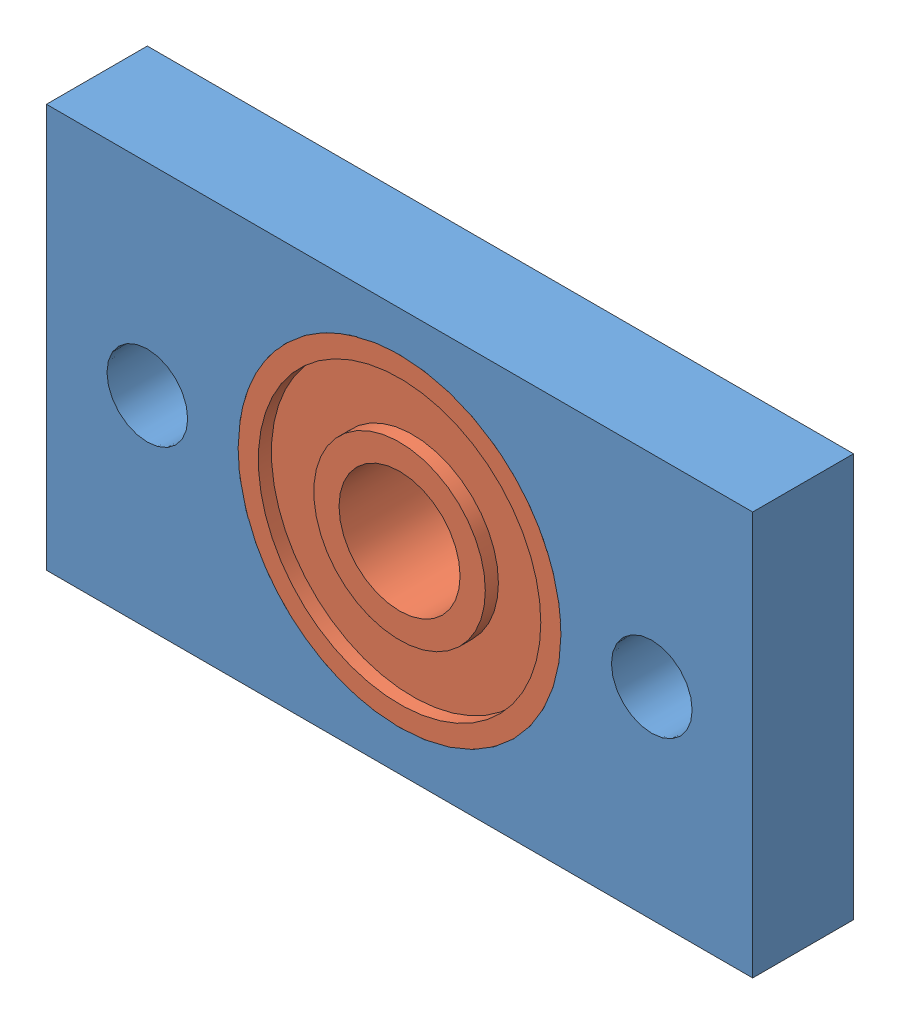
SolidWorks assembly Y-Rodamiento con soporte.SLDASM, configuration Predeterminado (file format 3800). Lengths in mm.
Overall size (70 40 10).
2 component instances, 2 part files, 0 mates.
Components (placement in the parent):
- Y-Soporte rodamiento-1: Y-Soporte rodamiento.SLDPRT [Predeterminado] at origin size (70 40 10)
- Y-Rodamiento (7201.2RS.TVP)-1: Y-Rodamiento (7201.2RS.TVP).SLDPRT [Predeterminado] at origin size (32 32 10)
